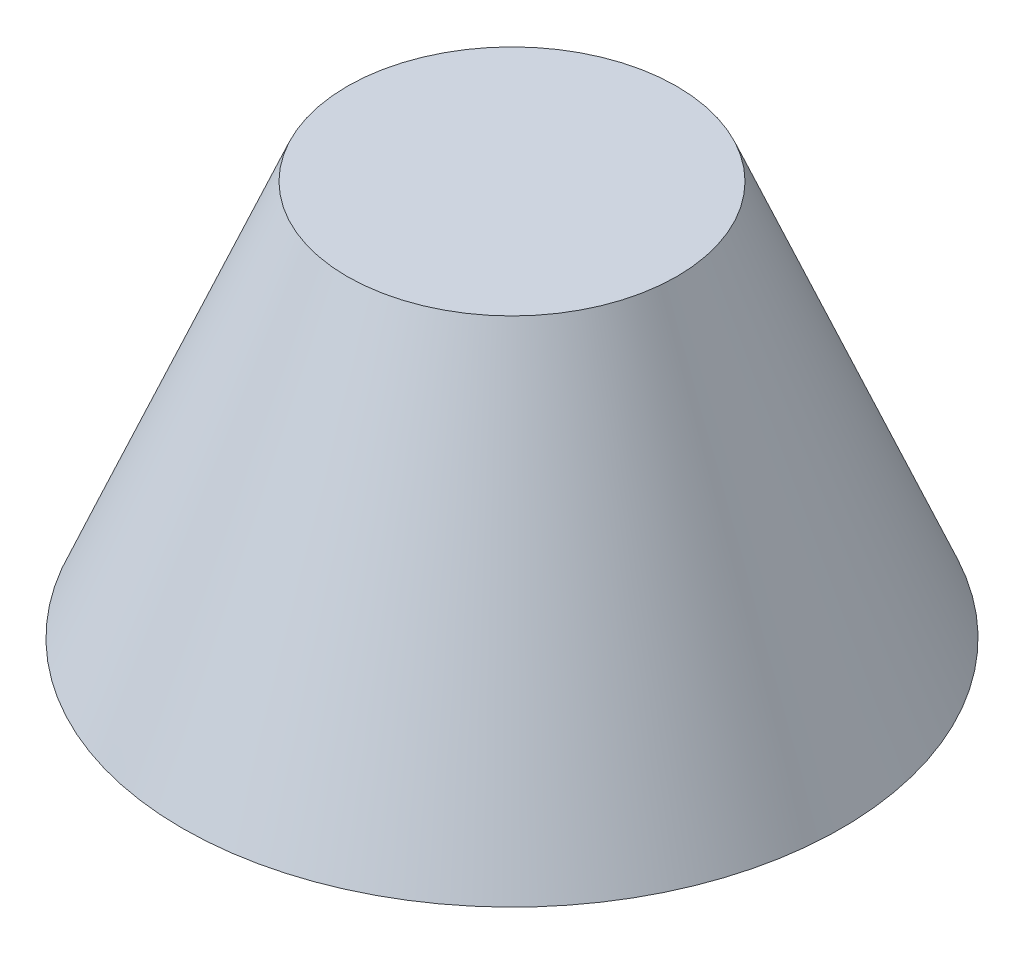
from build123d import *


with BuildPart() as part:
    # Sketch 1 → Revolve 1 (revolve)
    with BuildSketch(Plane.XY, mode=Mode.PRIVATE) as revolve_1_sk:
        Polygon((0, 34.608734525), (-25, 34.608734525), (-50, -25.391265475), (0, -25.391265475), align=None)
    revolve(revolve_1_sk.sketch.rotate(Axis((0, 42.021801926, 0), (0, -1, 0)), 270), axis=Axis((0, 42.021801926, 0), (0, -1, 0)))


solid = part.part
